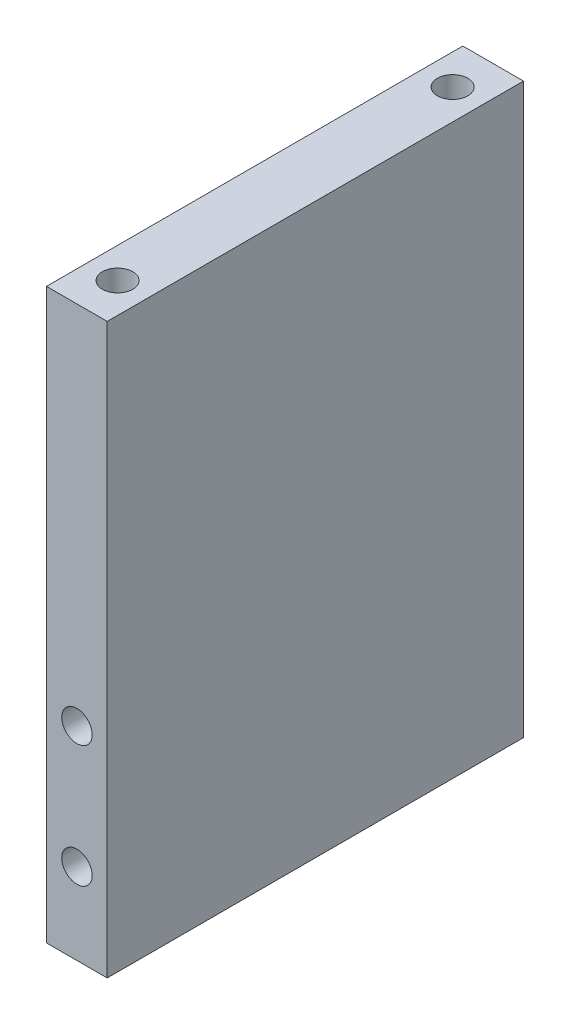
from build123d import *

# Parameters (mm, degrees)
SKETCH1_W           = 5.98
SKETCH1_H           = 41
BOSS_EXTRUDE1_DEPTH = 56
SKETCH1_3_R         = 1.5
CUT_EXTRUDE1_DEPTH  = 6
CUT_EXTRUDE2_START  = -6
SKETCH2_R           = 1.5
CUT_EXTRUDE2_DEPTH  = 6
SKETCH3_R           = 1.5
CUT_EXTRUDE4_DEPTH  = 59


with BuildPart() as part:
    # Sketch1 → Boss-Extrude1 (new body)
    with BuildSketch(Plane(origin=(0, 0, 0), x_dir=(1, 0, 0), z_dir=(0, 1, 0))):
        Rectangle(SKETCH1_W, SKETCH1_H)
    extrude(amount=BOSS_EXTRUDE1_DEPTH)

    # Sketch1_3 → Cut-Extrude1 (cut)
    with BuildSketch(Plane(origin=(0, 0, 0), x_dir=(1, 0, 0), z_dir=(0, 1, 0))):
        with Locations(Location((0.01, 16.5, 0), (0, 0, 270))):
            Circle(SKETCH1_3_R)
        with Locations(Location((0.01, -16.5, 0), (0, 0, 270))):
            Circle(SKETCH1_3_R)
    extrude(amount=CUT_EXTRUDE1_DEPTH, mode=Mode.SUBTRACT)

    # Sketch2 → Cut-Extrude2 (cut)
    with BuildSketch(Plane(origin=(0, 56, 0), x_dir=(1, 0, 0), z_dir=(0, 1, 0)).offset(CUT_EXTRUDE2_START)):
        with Locations(Location((0.01, 16.5, 0), (0, 0, 270))):
            Circle(SKETCH2_R)
        with Locations(Location((0.01, -16.5, 0), (0, 0, 270))):
            Circle(SKETCH2_R)
    extrude(amount=CUT_EXTRUDE2_DEPTH, mode=Mode.SUBTRACT)

    # Sketch3 → Cut-Extrude4 (cut)
    with BuildSketch(Plane(origin=(0, 0, -20.5), x_dir=(-1, 0, 0), z_dir=(0, 0, -1))):
        with Locations((-0.01, 8)):
            Circle(SKETCH3_R)
        with Locations((-0.01, 20)):
            Circle(SKETCH3_R)
    extrude(amount=-CUT_EXTRUDE4_DEPTH, mode=Mode.SUBTRACT)


solid = part.part
